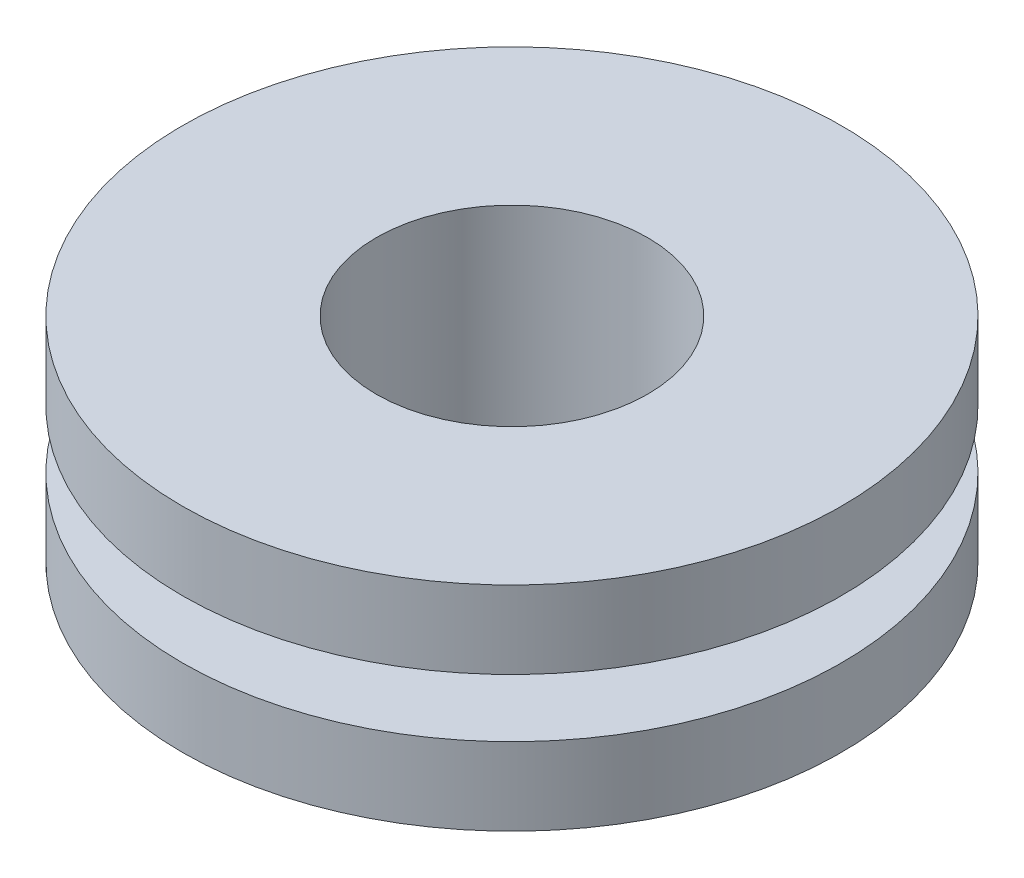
from build123d import *

# Parameters (mm, degrees)
SKETCH_1_R          = 8.5
EXTRUDE_1_DEPTH     = 2
SKETCH_2_R          = 5.5
EXTRUDE_2_DEPTH     = 1.5
SKETCH_3_R          = 8.5
EXTRUDE_3_DEPTH     = 2
SKETCH_4_R          = 3.5
CUT_EXTRUDE_1_DEPTH = 5.5


with BuildPart() as part:
    # Sketch 1 → Extrude 1 (new body)
    with BuildSketch(Plane(origin=(0, 0, 0), x_dir=(1, 0, 0), z_dir=(0, 1, 0))):
        with Locations(Location((0, 0, 0), (0, 0, 270))):
            Circle(SKETCH_1_R)
    extrude(amount=EXTRUDE_1_DEPTH)

    # Sketch 2 → Extrude 2 (add)
    with BuildSketch(Plane(origin=(0, 2, 0), x_dir=(1, 0, 0), z_dir=(0, 1, 0))):
        with Locations(Location((0, 0, 0), (0, 0, 270))):
            Circle(SKETCH_2_R)
    extrude(amount=EXTRUDE_2_DEPTH)

    # Sketch 3 → Extrude 3 (add)
    with BuildSketch(Plane(origin=(0, 3.5, 0), x_dir=(1, 0, 0), z_dir=(0, 1, 0))):
        with Locations(Location((0, 0, 0), (0, 0, 270))):
            Circle(SKETCH_3_R)
    extrude(amount=EXTRUDE_3_DEPTH)

    # Sketch 4 → Cut-Extrude 1 (cut)
    with BuildSketch(Plane(origin=(0, 5.5, 0), x_dir=(1, 0, 0), z_dir=(0, 1, 0))):
        with Locations(Location((0, 0, 0), (0, 0, 270))):
            Circle(SKETCH_4_R)
    extrude(amount=-CUT_EXTRUDE_1_DEPTH, mode=Mode.SUBTRACT)


solid = part.part
